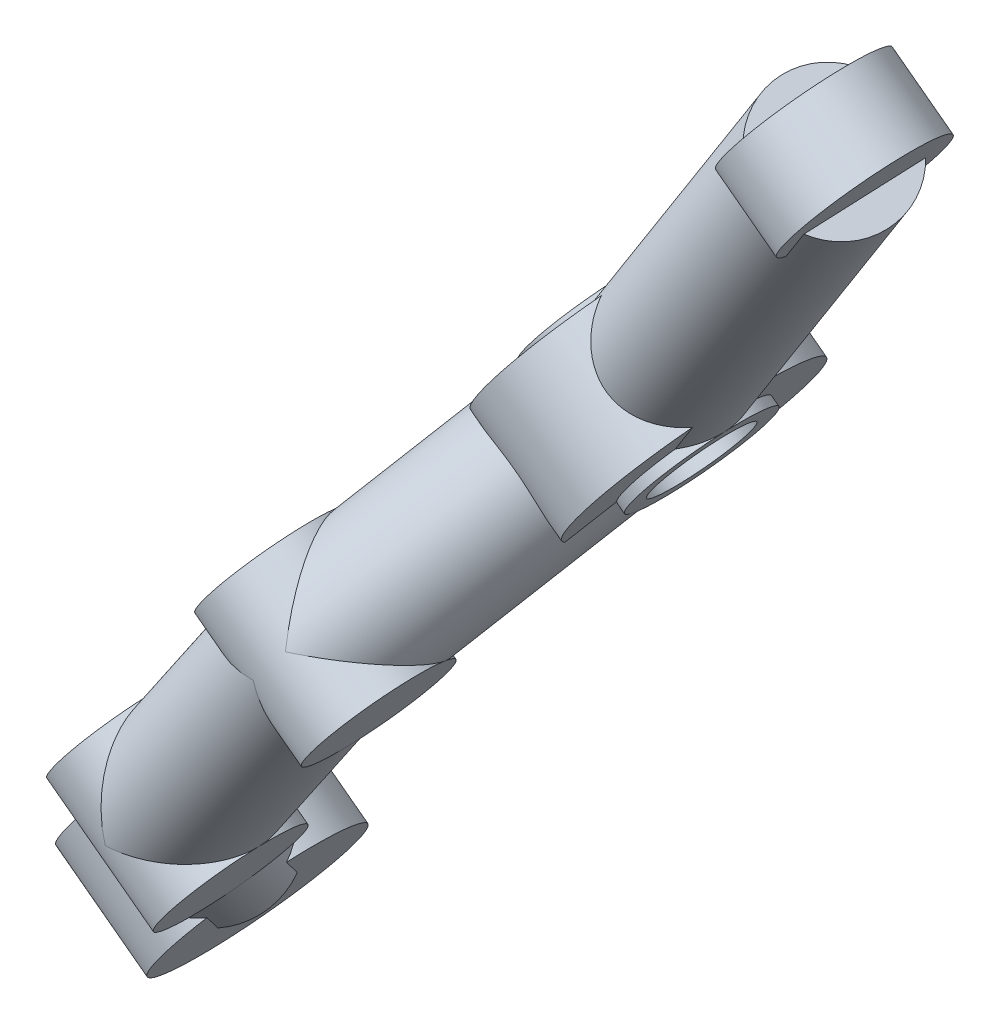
ISO-10303-21;
HEADER;
FILE_DESCRIPTION(('STEP AP214'),'2;1');
FILE_NAME('part.step','',(''),(''),'','','');
FILE_SCHEMA(('AUTOMOTIVE_DESIGN { 1 0 10303 214 1 1 1 1 }'));
ENDSEC;
DATA;
#1=APPLICATION_CONTEXT('core data for automotive mechanical design processes');
#2=APPLICATION_PROTOCOL_DEFINITION('international standard','automotive_design',2000,#1);
#3=PRODUCT_CONTEXT('',#1,'mechanical');
#4=PRODUCT('Part','Part','',(#3));
#5=PRODUCT_RELATED_PRODUCT_CATEGORY('part','',(#4));
#6=PRODUCT_DEFINITION_FORMATION('','',#4);
#7=PRODUCT_DEFINITION_CONTEXT('part definition',#1,'design');
#8=PRODUCT_DEFINITION('design','',#6,#7);
#9=PRODUCT_DEFINITION_SHAPE('','',#8);
#10=(LENGTH_UNIT() NAMED_UNIT(*) SI_UNIT(.MILLI.,.METRE.));
#11=(NAMED_UNIT(*) PLANE_ANGLE_UNIT() SI_UNIT($,.RADIAN.));
#12=(NAMED_UNIT(*) SI_UNIT($,.STERADIAN.) SOLID_ANGLE_UNIT());
#13=UNCERTAINTY_MEASURE_WITH_UNIT(LENGTH_MEASURE(1.E-05),#10,'distance_accuracy_value','');
#14=(GEOMETRIC_REPRESENTATION_CONTEXT(3) GLOBAL_UNCERTAINTY_ASSIGNED_CONTEXT((#13)) GLOBAL_UNIT_ASSIGNED_CONTEXT((#10,
#11,#12)) REPRESENTATION_CONTEXT('',''));
#15=CARTESIAN_POINT('',(0.,0.,0.));
#16=DIRECTION('',(0.,0.,1.));
#17=DIRECTION('',(1.,0.,0.));
#18=AXIS2_PLACEMENT_3D('',#15,#16,#17);
#19=CARTESIAN_POINT('',(-263.128358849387,316.504901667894,22.));
#20=DIRECTION('',(-0.479301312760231,-0.640523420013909,-0.600000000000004));
#21=DIRECTION('',(0.,0.683643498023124,-0.729816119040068));
#22=AXIS2_PLACEMENT_3D('',#19,#20,#21);
#23=PLANE('',#22);
#24=CARTESIAN_POINT('',(-263.128358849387,316.504901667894,22.));
#25=DIRECTION('',(-0.479301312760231,-0.640523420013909,-0.600000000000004));
#26=DIRECTION('',(0.,0.683643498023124,-0.729816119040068));
#27=AXIS2_PLACEMENT_3D('',#24,#25,#26);
#28=CIRCLE('',#27,3.5);
#29=CARTESIAN_POINT('',(-260.078341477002,315.573561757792,20.557779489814));
#30=VERTEX_POINT('',#29);
#31=CARTESIAN_POINT('',(-261.374450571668,313.841481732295,23.442220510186));
#32=VERTEX_POINT('',#31);
#33=EDGE_CURVE('E276',#30,#32,#28,.T.);
#34=ORIENTED_EDGE('',*,*,#33,.T.);
#35=DIRECTION('',(0.359475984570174,0.480392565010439,-0.799999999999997));
#36=VECTOR('',#35,1.);
#37=CARTESIAN_POINT('',(-260.726396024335,314.707521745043,22.));
#38=LINE('',#37,#36);
#39=EDGE_CURVE('E301',#32,#30,#38,.T.);
#40=ORIENTED_EDGE('',*,*,#39,.T.);
#41=EDGE_LOOP('',(#34,#40));
#42=FACE_BOUND('',#41,.T.);
#43=ADVANCED_FACE('F100',(#42),#23,.T.);
#44=CARTESIAN_POINT('',(-255.938839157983,326.112752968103,31.));
#45=DIRECTION('',(-0.479301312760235,-0.640523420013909,-0.6));
#46=DIRECTION('',(0.,0.683643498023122,-0.72981611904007));
#47=AXIS2_PLACEMENT_3D('',#44,#45,#46);
#48=CYLINDRICAL_SURFACE('',#47,3.5);
#49=CARTESIAN_POINT('',(-255.938839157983,326.112752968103,31.));
#50=DIRECTION('',(-0.905065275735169,-0.0292719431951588,-0.42426406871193));
#51=DIRECTION('',(0.227230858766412,-0.876564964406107,-0.424264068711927));
#52=AXIS2_PLACEMENT_3D('',#49,#50,#51);
#53=ELLIPSE('',#52,4.94974746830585,3.5);
#54=CARTESIAN_POINT('',(-254.814103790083,321.773977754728,28.9));
#55=VERTEX_POINT('',#54);
#56=CARTESIAN_POINT('',(-254.450036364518,326.718397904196,27.7822113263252));
#57=VERTEX_POINT('',#56);
#58=EDGE_CURVE('E557',#55,#57,#53,.F.);
#59=ORIENTED_EDGE('',*,*,#58,.F.);
#60=CARTESIAN_POINT('',(-257.197005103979,324.431378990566,33.8));
#61=VERTEX_POINT('',#60);
#62=EDGE_CURVE('E554',#61,#55,#53,.F.);
#63=ORIENTED_EDGE('',*,*,#62,.F.);
#64=CARTESIAN_POINT('',(-255.938839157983,326.112752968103,31.));
#65=DIRECTION('',(0.227230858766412,-0.876564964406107,-0.424264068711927));
#66=DIRECTION('',(-0.905065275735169,-0.0292719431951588,-0.42426406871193));
#67=AXIS2_PLACEMENT_3D('',#64,#65,#66);
#68=ELLIPSE('',#67,4.94974746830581,3.5);
#69=CARTESIAN_POINT('',(-260.418683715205,325.96786424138,28.9));
#70=VERTEX_POINT('',#69);
#71=EDGE_CURVE('E550',#70,#61,#68,.F.);
#72=ORIENTED_EDGE('',*,*,#71,.F.);
#73=CARTESIAN_POINT('',(-255.777774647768,327.711939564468,27.7822113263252));
#74=VERTEX_POINT('',#73);
#75=EDGE_CURVE('E553',#74,#70,#68,.F.);
#76=ORIENTED_EDGE('',*,*,#75,.F.);
#77=CARTESIAN_POINT('',(-255.938839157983,326.112752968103,31.));
#78=DIRECTION('',(-0.55081797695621,-0.736096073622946,-0.393398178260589));
#79=DIRECTION('',(-0.235695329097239,-0.314975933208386,0.919368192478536));
#80=AXIS2_PLACEMENT_3D('',#77,#78,#79);
#81=ELLIPSE('',#80,3.60255219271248,3.49999999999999);
#82=EDGE_CURVE('E533',#74,#57,#81,.T.);
#83=ORIENTED_EDGE('',*,*,#82,.T.);
#84=EDGE_LOOP('',(#59,#63,#72,#76,#83));
#85=FACE_BOUND('',#84,.T.);
#86=CARTESIAN_POINT('',(-259.139138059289,316.82868409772,26.2404342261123));
#87=CARTESIAN_POINT('',(-259.231834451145,316.795448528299,26.2917693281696));
#88=CARTESIAN_POINT('',(-259.327323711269,316.764696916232,26.3395642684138));
#89=CARTESIAN_POINT('',(-259.522848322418,316.708625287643,26.4284221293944));
#90=CARTESIAN_POINT('',(-259.622880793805,316.683301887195,26.4694892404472));
#91=CARTESIAN_POINT('',(-259.827173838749,316.638375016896,26.54552754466));
#92=CARTESIAN_POINT('',(-259.931455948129,316.618806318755,26.5804611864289));
#93=CARTESIAN_POINT('',(-260.142822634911,316.58612289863,26.6444042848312));
#94=CARTESIAN_POINT('',(-260.249907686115,316.57300927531,26.673412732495));
#95=CARTESIAN_POINT('',(-260.46588295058,316.55390552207,26.7259561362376));
#96=CARTESIAN_POINT('',(-260.574770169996,316.547904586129,26.7494993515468));
#97=CARTESIAN_POINT('',(-260.793595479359,316.543781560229,26.7916828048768));
#98=CARTESIAN_POINT('',(-260.903533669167,316.545660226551,26.8103225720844));
#99=CARTESIAN_POINT('',(-261.233055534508,316.564552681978,26.8595835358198));
#100=CARTESIAN_POINT('',(-261.453234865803,316.594730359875,26.8837507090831));
#101=CARTESIAN_POINT('',(-261.815008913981,316.682612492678,26.9132893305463));
#102=CARTESIAN_POINT('',(-261.95922846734,316.728436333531,26.9221993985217));
#103=CARTESIAN_POINT('',(-262.238465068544,316.842914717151,26.9351209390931));
#104=CARTESIAN_POINT('',(-262.373498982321,316.911525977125,26.9391416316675));
#105=CARTESIAN_POINT('',(-262.62994440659,317.07211858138,26.9430304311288));
#106=CARTESIAN_POINT('',(-262.751286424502,317.164212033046,26.9428782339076));
#107=CARTESIAN_POINT('',(-262.975660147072,317.368480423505,26.938342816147));
#108=CARTESIAN_POINT('',(-263.078674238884,317.48067447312,26.9339555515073));
#109=CARTESIAN_POINT('',(-263.280433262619,317.739542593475,26.9190282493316));
#110=CARTESIAN_POINT('',(-263.375697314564,317.888853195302,26.90759591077));
#111=CARTESIAN_POINT('',(-263.541707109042,318.199824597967,26.8759660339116));
#112=CARTESIAN_POINT('',(-263.612387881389,318.361516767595,26.8557455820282));
#113=CARTESIAN_POINT('',(-263.748518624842,318.736026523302,26.7973236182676));
#114=CARTESIAN_POINT('',(-263.807259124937,318.950738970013,26.7557181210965));
#115=CARTESIAN_POINT('',(-263.894622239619,319.380513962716,26.6504126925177));
#116=CARTESIAN_POINT('',(-263.923291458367,319.595575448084,26.5867471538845));
#117=CARTESIAN_POINT('',(-263.945803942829,319.912208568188,26.4718899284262));
#118=CARTESIAN_POINT('',(-263.949896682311,320.016696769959,26.4304094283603));
#119=CARTESIAN_POINT('',(-263.951423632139,320.222594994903,26.3406357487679));
#120=CARTESIAN_POINT('',(-263.948865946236,320.324008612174,26.2923509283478));
#121=CARTESIAN_POINT('',(-263.943063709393,320.423443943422,26.2404342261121));
#122=B_SPLINE_CURVE_WITH_KNOTS('',3,(#86,#87,#88,#89,#90,#91,#92,#93,#94,#95,#96,#97,#98,#99,
#100,#101,#102,#103,#104,#105,#106,#107,#108,#109,#110,#111,#112,#113,#114,#115,#116,#117,#118,
#119,#120,#121),.UNSPECIFIED.,.F.,.F.,(4,2,2,2,2,2,2,2,2,2,2,2,2,2,2,2,2,4),(0.,
0.332966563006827,0.665724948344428,1.00045449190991,1.33524098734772,1.66951820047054,
2.00382749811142,2.66972985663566,3.12280153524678,3.57501751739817,4.02943424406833,
4.48428532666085,5.01385226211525,5.5448083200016,6.22088122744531,6.89590480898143,
7.23299855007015,7.56968172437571),.UNSPECIFIED.);
#123=CARTESIAN_POINT('',(-259.139138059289,316.82868409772,26.2404342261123));
#124=VERTEX_POINT('',#123);
#125=CARTESIAN_POINT('',(-263.943063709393,320.423443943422,26.2404342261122));
#126=VERTEX_POINT('',#125);
#127=EDGE_CURVE('E118',#124,#126,#122,.T.);
#128=ORIENTED_EDGE('',*,*,#127,.F.);
#129=DIRECTION('',(-0.479301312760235,-0.640523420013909,-0.6));
#130=VECTOR('',#129,1.);
#131=CARTESIAN_POINT('',(-254.184930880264,323.449333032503,32.442220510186));
#132=LINE('',#131,#130);
#133=EDGE_CURVE('E12',#124,#32,#132,.T.);
#134=ORIENTED_EDGE('',*,*,#133,.T.);
#135=ORIENTED_EDGE('',*,*,#33,.F.);
#136=DIRECTION('',(-0.479301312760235,-0.640523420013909,-0.6));
#137=VECTOR('',#136,1.);
#138=CARTESIAN_POINT('',(-252.888821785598,325.181413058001,29.557779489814));
#139=LINE('',#138,#137);
#140=CARTESIAN_POINT('',(-257.843028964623,318.560764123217,23.3559932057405));
#141=VERTEX_POINT('',#140);
#142=EDGE_CURVE('E270',#30,#141,#139,.F.);
#143=ORIENTED_EDGE('',*,*,#142,.T.);
#144=CARTESIAN_POINT('',(-262.646954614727,322.155523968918,23.3559932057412));
#145=CARTESIAN_POINT('',(-262.587729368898,322.144029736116,23.2627581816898));
#146=CARTESIAN_POINT('',(-262.52750546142,322.12765382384,23.1708172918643));
#147=CARTESIAN_POINT('',(-262.405137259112,322.085961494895,22.9903806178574));
#148=CARTESIAN_POINT('',(-262.34299418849,322.060650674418,22.9018827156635));
#149=CARTESIAN_POINT('',(-262.216416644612,322.001720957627,22.728558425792));
#150=CARTESIAN_POINT('',(-262.151970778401,321.96805373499,22.6437568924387));
#151=CARTESIAN_POINT('',(-262.02100877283,321.893286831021,22.4791614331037));
#152=CARTESIAN_POINT('',(-261.954492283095,321.852185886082,22.3993683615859));
#153=CARTESIAN_POINT('',(-261.819257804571,321.763390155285,22.2457518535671));
#154=CARTESIAN_POINT('',(-261.750543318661,321.715705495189,22.1719195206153));
#155=CARTESIAN_POINT('',(-261.610528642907,321.614508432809,22.0310791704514));
#156=CARTESIAN_POINT('',(-261.539228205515,321.560995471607,21.9640718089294));
#157=CARTESIAN_POINT('',(-261.321175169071,321.393139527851,21.7752716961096));
#158=CARTESIAN_POINT('',(-261.169729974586,321.271107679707,21.6650616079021));
#159=CARTESIAN_POINT('',(-260.903226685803,321.055908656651,21.5162609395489));
#160=CARTESIAN_POINT('',(-260.792009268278,320.965981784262,21.4660380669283));
#161=CARTESIAN_POINT('',(-260.563348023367,320.783916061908,21.3898051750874));
#162=CARTESIAN_POINT('',(-260.445916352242,320.691781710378,21.3637496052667));
#163=CARTESIAN_POINT('',(-260.206455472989,320.508491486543,21.3385991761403));
#164=CARTESIAN_POINT('',(-260.084406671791,320.417342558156,21.3396361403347));
#165=CARTESIAN_POINT('',(-259.840309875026,320.239431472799,21.3688613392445));
#166=CARTESIAN_POINT('',(-259.718261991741,320.152673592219,21.3970755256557));
#167=CARTESIAN_POINT('',(-259.458841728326,319.970862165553,21.4841844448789));
#168=CARTESIAN_POINT('',(-259.322245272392,319.876786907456,21.5473576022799));
#169=CARTESIAN_POINT('',(-259.059763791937,319.69473727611,21.6997528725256));
#170=CARTESIAN_POINT('',(-258.933907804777,319.606779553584,21.7890428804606));
#171=CARTESIAN_POINT('',(-258.663973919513,319.411080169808,22.0149625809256));
#172=CARTESIAN_POINT('',(-258.524317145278,319.304501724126,22.1578608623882));
#173=CARTESIAN_POINT('',(-258.273776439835,319.092792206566,22.4674356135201));
#174=CARTESIAN_POINT('',(-258.162848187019,318.987659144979,22.6340748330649));
#175=CARTESIAN_POINT('',(-258.022325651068,318.828731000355,22.8966596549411));
#176=CARTESIAN_POINT('',(-257.979814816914,318.775583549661,22.9862327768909));
#177=CARTESIAN_POINT('',(-257.904200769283,318.668693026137,23.1687503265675));
#178=CARTESIAN_POINT('',(-257.87108616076,318.614950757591,23.2616905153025));
#179=CARTESIAN_POINT('',(-257.843028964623,318.560764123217,23.3559932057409));
#180=B_SPLINE_CURVE_WITH_KNOTS('',3,(#144,#145,#146,#147,#148,#149,#150,#151,#152,#153,#154,
#155,#156,#157,#158,#159,#160,#161,#162,#163,#164,#165,#166,#167,#168,#169,#170,#171,#172,#173,
#174,#175,#176,#177,#178,#179),.UNSPECIFIED.,.F.,.F.,(4,2,2,2,2,2,2,2,2,2,2,2,2,2,2,2,2,4),(0.,
0.332966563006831,0.665724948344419,1.00045449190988,1.33524098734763,1.6695182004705,
2.00382749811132,2.66972985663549,3.12280153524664,3.57501751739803,4.0294342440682,
4.48428532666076,5.01385226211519,5.54480832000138,6.22088122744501,6.89590480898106,
7.23299855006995,7.5696817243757),.UNSPECIFIED.);
#181=CARTESIAN_POINT('',(-262.646954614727,322.155523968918,23.3559932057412));
#182=VERTEX_POINT('',#181);
#183=EDGE_CURVE('E273',#182,#141,#180,.T.);
#184=ORIENTED_EDGE('',*,*,#183,.F.);
#185=DIRECTION('',(-0.479301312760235,-0.640523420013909,-0.6));
#186=VECTOR('',#185,1.);
#187=CARTESIAN_POINT('',(-257.692747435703,328.776172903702,29.5577794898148));
#188=LINE('',#187,#186);
#189=CARTESIAN_POINT('',(-264.882267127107,319.168321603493,20.5577794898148));
#190=VERTEX_POINT('',#189);
#191=EDGE_CURVE('E280',#190,#182,#188,.F.);
#192=ORIENTED_EDGE('',*,*,#191,.F.);
#193=CARTESIAN_POINT('',(-266.178376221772,317.436241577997,23.4422205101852));
#194=VERTEX_POINT('',#193);
#195=EDGE_CURVE('E456',#194,#190,#28,.T.);
#196=ORIENTED_EDGE('',*,*,#195,.F.);
#197=DIRECTION('',(-0.479301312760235,-0.640523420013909,-0.6));
#198=VECTOR('',#197,1.);
#199=CARTESIAN_POINT('',(-258.988856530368,327.044092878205,32.4422205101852));
#200=LINE('',#199,#198);
#201=EDGE_CURVE('E109',#126,#194,#200,.T.);
#202=ORIENTED_EDGE('',*,*,#201,.F.);
#203=EDGE_LOOP('',(#128,#134,#135,#143,#184,#192,#196,#202));
#204=FACE_BOUND('',#203,.T.);
#205=ADVANCED_FACE('F272',(#85,#204),#48,.T.);
#206=CARTESIAN_POINT('',(-219.392114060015,374.952663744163,33.));
#207=DIRECTION('',(-0.581238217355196,-0.776748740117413,-0.242535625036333));
#208=DIRECTION('',(0.800654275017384,-0.599126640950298,0.));
#209=AXIS2_PLACEMENT_3D('',#206,#207,#208);
#210=CYLINDRICAL_SURFACE('',#209,3.49999999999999);
#211=CARTESIAN_POINT('',(-230.701369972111,354.832036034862,29.1369228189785));
#212=CARTESIAN_POINT('',(-230.772728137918,354.825094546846,29.2157090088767));
#213=CARTESIAN_POINT('',(-230.847452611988,354.819776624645,29.2915448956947));
#214=CARTESIAN_POINT('',(-231.002721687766,354.812815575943,29.437133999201));
#215=CARTESIAN_POINT('',(-231.08326413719,354.811171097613,29.5068894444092));
#216=CARTESIAN_POINT('',(-231.249639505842,354.811980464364,29.640457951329));
#217=CARTESIAN_POINT('',(-231.335492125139,354.814450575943,29.7042463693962));
#218=CARTESIAN_POINT('',(-231.511310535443,354.824017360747,29.8254576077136));
#219=CARTESIAN_POINT('',(-231.601276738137,354.831114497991,29.8828797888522));
#220=CARTESIAN_POINT('',(-231.87599352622,354.860157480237,30.0454035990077));
#221=CARTESIAN_POINT('',(-232.065781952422,354.889853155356,30.1409358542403));
#222=CARTESIAN_POINT('',(-232.450841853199,354.974993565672,30.3049910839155));
#223=CARTESIAN_POINT('',(-232.646100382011,355.030381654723,30.3735728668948));
#224=CARTESIAN_POINT('',(-232.991910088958,355.156640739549,30.4705902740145));
#225=CARTESIAN_POINT('',(-233.143063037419,355.22163815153,30.5044828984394));
#226=CARTESIAN_POINT('',(-233.438193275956,355.371744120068,30.5537054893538));
#227=CARTESIAN_POINT('',(-233.582178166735,355.456830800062,30.569055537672));
#228=CARTESIAN_POINT('',(-233.85823026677,355.646354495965,30.5806395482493));
#229=CARTESIAN_POINT('',(-233.990265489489,355.750841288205,30.5768236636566));
#230=CARTESIAN_POINT('',(-234.238178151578,355.975409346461,30.5501241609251));
#231=CARTESIAN_POINT('',(-234.354046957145,356.095498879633,30.5272303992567));
#232=CARTESIAN_POINT('',(-234.564912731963,356.342413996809,30.4641353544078));
#233=CARTESIAN_POINT('',(-234.660414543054,356.468946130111,30.4244513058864));
#234=CARTESIAN_POINT('',(-234.835055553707,356.727038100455,30.3287850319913));
#235=CARTESIAN_POINT('',(-234.914183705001,356.858601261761,30.2727918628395));
#236=CARTESIAN_POINT('',(-235.068338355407,357.142998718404,30.1352878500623));
#237=CARTESIAN_POINT('',(-235.140803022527,357.295952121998,30.0511599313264));
#238=CARTESIAN_POINT('',(-235.267279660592,357.596949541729,29.8628365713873));
#239=CARTESIAN_POINT('',(-235.321299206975,357.744995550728,29.7586493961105));
#240=CARTESIAN_POINT('',(-235.397298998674,357.98338235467,29.5686043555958));
#241=CARTESIAN_POINT('',(-235.423963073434,358.076574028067,29.4881313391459));
#242=CARTESIAN_POINT('',(-235.47000273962,358.256714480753,29.3187867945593));
#243=CARTESIAN_POINT('',(-235.489386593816,358.343670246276,29.2299249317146));
#244=CARTESIAN_POINT('',(-235.505295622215,358.426795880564,29.1369228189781));
#245=B_SPLINE_CURVE_WITH_KNOTS('',3,(#211,#212,#213,#214,#215,#216,#217,#218,#219,#220,#221,
#222,#223,#224,#225,#226,#227,#228,#229,#230,#231,#232,#233,#234,#235,#236,#237,#238,#239,#240,
#241,#242,#243,#244),.UNSPECIFIED.,.F.,.F.,(4,2,2,2,2,2,2,2,2,2,2,2,2,2,2,2,4),(0.,
0.319418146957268,0.638718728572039,0.959284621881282,1.27988266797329,1.92024942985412,
2.55921098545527,3.06104886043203,3.5623427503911,4.06494108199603,4.5678068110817,
5.05619570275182,5.54491307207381,6.10980771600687,6.6744700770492,7.05181727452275,
7.42873489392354),.UNSPECIFIED.);
#246=CARTESIAN_POINT('',(-230.701369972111,354.832036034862,29.1369228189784));
#247=VERTEX_POINT('',#246);
#248=CARTESIAN_POINT('',(-235.505295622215,358.426795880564,29.1369228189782));
#249=VERTEX_POINT('',#248);
#250=EDGE_CURVE('E391',#247,#249,#245,.T.);
#251=ORIENTED_EDGE('',*,*,#250,.F.);
#252=DIRECTION('',(-0.581238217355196,-0.776748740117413,-0.242535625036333));
#253=VECTOR('',#252,1.);
#254=CARTESIAN_POINT('',(-217.252111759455,372.805207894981,34.7489492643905));
#255=LINE('',#254,#253);
#256=CARTESIAN_POINT('',(-232.283943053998,352.717134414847,28.4765561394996));
#257=VERTEX_POINT('',#256);
#258=EDGE_CURVE('E327',#247,#257,#255,.T.);
#259=ORIENTED_EDGE('',*,*,#258,.T.);
#260=CARTESIAN_POINT('',(-236.167660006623,352.534344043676,26.));
#261=DIRECTION('',(0.155150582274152,-0.972890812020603,-0.171498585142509));
#262=DIRECTION('',(-0.977145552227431,-0.125597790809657,-0.171498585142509));
#263=AXIS2_PLACEMENT_3D('',#260,#261,#262);
#264=ELLIPSE('',#263,4.94974746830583,3.5);
#265=CARTESIAN_POINT('',(-231.331036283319,353.156021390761,26.8488746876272));
#266=VERTEX_POINT('',#265);
#267=EDGE_CURVE('E509',#266,#257,#264,.T.);
#268=ORIENTED_EDGE('',*,*,#267,.F.);
#269=CARTESIAN_POINT('',(-231.760022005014,353.417286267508,24.9786576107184));
#270=VERTEX_POINT('',#269);
#271=EDGE_CURVE('E523',#270,#266,#264,.T.);
#272=ORIENTED_EDGE('',*,*,#271,.F.);
#273=DIRECTION('',(-0.581238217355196,-0.776748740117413,-0.242535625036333));
#274=VECTOR('',#273,1.);
#275=CARTESIAN_POINT('',(-216.728190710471,373.505359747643,31.2510507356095));
#276=LINE('',#275,#274);
#277=CARTESIAN_POINT('',(-230.177448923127,355.532187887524,25.6390242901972));
#278=VERTEX_POINT('',#277);
#279=EDGE_CURVE('E335',#270,#278,#276,.F.);
#280=ORIENTED_EDGE('',*,*,#279,.T.);
#281=CARTESIAN_POINT('',(-234.981374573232,359.126947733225,25.6390242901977));
#282=CARTESIAN_POINT('',(-234.942286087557,359.090765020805,25.5467728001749));
#283=CARTESIAN_POINT('',(-234.901471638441,359.050766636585,25.4567871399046));
#284=CARTESIAN_POINT('',(-234.816351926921,358.963982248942,25.2819265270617));
#285=CARTESIAN_POINT('',(-234.772047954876,358.917198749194,25.1970497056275));
#286=CARTESIAN_POINT('',(-234.67969900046,358.817462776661,25.0325918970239));
#287=CARTESIAN_POINT('',(-234.631639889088,358.764486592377,24.9530332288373));
#288=CARTESIAN_POINT('',(-234.531804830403,358.653378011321,24.8001161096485));
#289=CARTESIAN_POINT('',(-234.480028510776,358.595245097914,24.7267582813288));
#290=CARTESIAN_POINT('',(-234.31888448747,358.414426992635,24.5168435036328));
#291=CARTESIAN_POINT('',(-234.203583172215,358.285189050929,24.3902297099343));
#292=CARTESIAN_POINT('',(-233.955567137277,358.016907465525,24.1689896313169));
#293=CARTESIAN_POINT('',(-233.822891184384,357.877885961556,24.0742937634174));
#294=CARTESIAN_POINT('',(-233.569377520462,357.628285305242,23.938763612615));
#295=CARTESIAN_POINT('',(-233.452109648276,357.518004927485,23.8907316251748));
#296=CARTESIAN_POINT('',(-233.206975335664,357.301085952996,23.8206470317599));
#297=CARTESIAN_POINT('',(-233.079120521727,357.19444353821,23.7985663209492));
#298=CARTESIAN_POINT('',(-232.815193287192,356.988716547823,23.7819229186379));
#299=CARTESIAN_POINT('',(-232.67910034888,356.889652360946,23.7874319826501));
#300=CARTESIAN_POINT('',(-232.403449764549,356.702152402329,23.8257058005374));
#301=CARTESIAN_POINT('',(-232.263890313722,356.613722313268,23.8584850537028));
#302=CARTESIAN_POINT('',(-231.99033804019,356.450579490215,23.9477375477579));
#303=CARTESIAN_POINT('',(-231.856300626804,356.375545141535,24.0035015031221));
#304=CARTESIAN_POINT('',(-231.593587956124,356.235149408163,24.1359177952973));
#305=CARTESIAN_POINT('',(-231.464916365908,356.169794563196,24.2125841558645));
#306=CARTESIAN_POINT('',(-231.19689113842,356.037570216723,24.397603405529));
#307=CARTESIAN_POINT('',(-231.058998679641,355.972052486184,24.5090326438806));
#308=CARTESIAN_POINT('',(-230.799289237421,355.849103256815,24.752950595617));
#309=CARTESIAN_POINT('',(-230.677465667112,355.79166844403,24.8854306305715));
#310=CARTESIAN_POINT('',(-230.491146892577,355.700708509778,25.1215089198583));
#311=CARTESIAN_POINT('',(-230.421040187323,355.665572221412,25.2201094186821));
#312=CARTESIAN_POINT('',(-230.291195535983,355.597426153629,25.4244236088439));
#313=CARTESIAN_POINT('',(-230.231445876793,355.564413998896,25.5301290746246));
#314=CARTESIAN_POINT('',(-230.177448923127,355.532187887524,25.6390242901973));
#315=B_SPLINE_CURVE_WITH_KNOTS('',3,(#281,#282,#283,#284,#285,#286,#287,#288,#289,#290,#291,
#292,#293,#294,#295,#296,#297,#298,#299,#300,#301,#302,#303,#304,#305,#306,#307,#308,#309,#310,
#311,#312,#313,#314),.UNSPECIFIED.,.F.,.F.,(4,2,2,2,2,2,2,2,2,2,2,2,2,2,2,2,4),(0.,
0.319418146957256,0.638718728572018,0.959284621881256,1.27988266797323,1.92024942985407,
2.55921098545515,3.06104886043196,3.56234275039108,4.06494108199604,4.56780681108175,
5.05619570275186,5.54491307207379,6.10980771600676,6.67447007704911,7.05181727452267,
7.42873489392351),.UNSPECIFIED.);
#316=CARTESIAN_POINT('',(-234.981374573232,359.126947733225,25.6390242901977));
#317=VERTEX_POINT('',#316);
#318=EDGE_CURVE('E383',#317,#278,#315,.T.);
#319=ORIENTED_EDGE('',*,*,#318,.F.);
#320=DIRECTION('',(-0.581238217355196,-0.776748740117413,-0.242535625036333));
#321=VECTOR('',#320,1.);
#322=CARTESIAN_POINT('',(-221.532116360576,377.100119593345,31.2510507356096));
#323=LINE('',#322,#321);
#324=CARTESIAN_POINT('',(-236.563947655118,357.01204611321,24.9786576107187));
#325=VERTEX_POINT('',#324);
#326=EDGE_CURVE('E339',#325,#317,#323,.F.);
#327=ORIENTED_EDGE('',*,*,#326,.F.);
#328=CARTESIAN_POINT('',(-236.167660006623,352.534344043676,26.));
#329=DIRECTION('',(-0.977145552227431,-0.125597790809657,-0.171498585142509));
#330=DIRECTION('',(0.155150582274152,-0.972890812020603,-0.171498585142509));
#331=AXIS2_PLACEMENT_3D('',#328,#329,#330);
#332=ELLIPSE('',#331,4.94974746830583,3.5);
#333=CARTESIAN_POINT('',(-236.935616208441,357.349907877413,26.8488746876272));
#334=VERTEX_POINT('',#333);
#335=EDGE_CURVE('E524',#334,#325,#332,.T.);
#336=ORIENTED_EDGE('',*,*,#335,.F.);
#337=CARTESIAN_POINT('',(-237.087868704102,356.311894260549,28.4765561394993));
#338=VERTEX_POINT('',#337);
#339=EDGE_CURVE('E458',#338,#334,#332,.T.);
#340=ORIENTED_EDGE('',*,*,#339,.F.);
#341=DIRECTION('',(-0.581238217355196,-0.776748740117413,-0.242535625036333));
#342=VECTOR('',#341,1.);
#343=CARTESIAN_POINT('',(-222.056037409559,376.399967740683,34.7489492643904));
#344=LINE('',#343,#342);
#345=EDGE_CURVE('E347',#249,#338,#344,.T.);
#346=ORIENTED_EDGE('',*,*,#345,.F.);
#347=EDGE_LOOP('',(#251,#259,#268,#272,#280,#319,#327,#336,#340,#346));
#348=FACE_BOUND('',#347,.T.);
#349=CARTESIAN_POINT('',(-218.991534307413,372.149793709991,29.5382872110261));
#350=CARTESIAN_POINT('',(-219.01085749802,372.238185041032,29.5039990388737));
#351=CARTESIAN_POINT('',(-219.031821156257,372.32715161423,29.4720776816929));
#352=CARTESIAN_POINT('',(-219.077775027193,372.505751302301,29.4127378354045));
#353=CARTESIAN_POINT('',(-219.102773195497,372.595385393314,29.3853284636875));
#354=CARTESIAN_POINT('',(-219.158025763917,372.77629712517,29.3344053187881));
#355=CARTESIAN_POINT('',(-219.188376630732,372.86757116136,29.3109820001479));
#356=CARTESIAN_POINT('',(-219.25506614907,373.048882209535,29.268595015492));
#357=CARTESIAN_POINT('',(-219.291399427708,373.138920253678,29.2496273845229));
#358=CARTESIAN_POINT('',(-219.380105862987,373.335485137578,29.2124239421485));
#359=CARTESIAN_POINT('',(-219.434247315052,373.441430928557,29.1952078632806));
#360=CARTESIAN_POINT('',(-219.556513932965,373.645275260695,29.1671674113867));
#361=CARTESIAN_POINT('',(-219.624553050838,373.743218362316,29.1563052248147));
#362=CARTESIAN_POINT('',(-219.764181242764,373.910213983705,29.142261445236));
#363=CARTESIAN_POINT('',(-219.833151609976,373.981338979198,29.1380808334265));
#364=CARTESIAN_POINT('',(-219.982133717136,374.111046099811,29.1341701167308));
#365=CARTESIAN_POINT('',(-220.062137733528,374.169636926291,29.1344369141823));
#366=CARTESIAN_POINT('',(-220.230342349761,374.27244838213,29.1393992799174));
#367=CARTESIAN_POINT('',(-220.31851679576,374.316712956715,29.1440811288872));
#368=CARTESIAN_POINT('',(-220.500083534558,374.392117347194,29.1577747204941));
#369=CARTESIAN_POINT('',(-220.593487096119,374.423227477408,29.1667961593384));
#370=CARTESIAN_POINT('',(-220.770743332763,374.471287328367,29.1877007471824));
#371=CARTESIAN_POINT('',(-220.854321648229,374.489525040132,29.1990819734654));
#372=CARTESIAN_POINT('',(-221.022172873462,374.519279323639,29.225120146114));
#373=CARTESIAN_POINT('',(-221.106446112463,374.530792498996,29.2397787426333));
#374=CARTESIAN_POINT('',(-221.275112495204,374.548479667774,29.2724624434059));
#375=CARTESIAN_POINT('',(-221.35950534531,374.554639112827,29.2904965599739));
#376=CARTESIAN_POINT('',(-221.527643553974,374.562647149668,29.3299809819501));
#377=CARTESIAN_POINT('',(-221.611389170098,374.564497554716,29.3514298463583));
#378=CARTESIAN_POINT('',(-221.779397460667,374.564726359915,29.3982740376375));
#379=CARTESIAN_POINT('',(-221.863642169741,374.563041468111,29.4237336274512));
#380=CARTESIAN_POINT('',(-222.030245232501,374.556713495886,29.4782632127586));
#381=CARTESIAN_POINT('',(-222.112612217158,374.552089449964,29.5073090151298));
#382=CARTESIAN_POINT('',(-222.194151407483,374.546300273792,29.5382872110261));
#383=B_SPLINE_CURVE_WITH_KNOTS('',3,(#349,#350,#351,#352,#353,#354,#355,#356,#357,#358,#359,
#360,#361,#362,#363,#364,#365,#366,#367,#368,#369,#370,#371,#372,#373,#374,#375,#376,#377,#378,
#379,#380,#381,#382),.UNSPECIFIED.,.F.,.F.,(4,2,2,2,2,2,2,2,2,2,2,2,2,2,2,2,4),(0.,
0.290250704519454,0.581080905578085,0.877819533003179,1.1742930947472,1.53402688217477,
1.89159743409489,2.18772895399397,2.48365422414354,2.77866295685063,3.07433392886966,
3.33285850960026,3.59151355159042,3.85086929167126,4.11011587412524,4.37404327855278,
4.63627861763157),.UNSPECIFIED.);
#384=CARTESIAN_POINT('',(-218.991534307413,372.149793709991,29.5382872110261));
#385=VERTEX_POINT('',#384);
#386=CARTESIAN_POINT('',(-222.194151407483,374.546300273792,29.538287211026));
#387=VERTEX_POINT('',#386);
#388=EDGE_CURVE('E289',#385,#387,#383,.T.);
#389=ORIENTED_EDGE('',*,*,#388,.F.);
#390=DIRECTION('',(-0.581238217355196,-0.776748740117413,-0.242535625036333));
#391=VECTOR('',#390,1.);
#392=CARTESIAN_POINT('',(-217.37343559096,374.31217068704,30.2134778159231));
#393=LINE('',#392,#391);
#394=CARTESIAN_POINT('',(-217.37343559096,374.31217068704,30.2134778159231));
#395=VERTEX_POINT('',#394);
#396=EDGE_CURVE('E316',#385,#395,#393,.F.);
#397=ORIENTED_EDGE('',*,*,#396,.T.);
#398=CARTESIAN_POINT('',(-219.392114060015,374.952663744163,33.));
#399=DIRECTION('',(-0.581238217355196,-0.776748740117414,-0.242535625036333));
#400=DIRECTION('',(0.800654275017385,-0.599126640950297,0.));
#401=AXIS2_PLACEMENT_3D('',#398,#399,#400);
#402=CIRCLE('',#401,3.49999999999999);
#403=CARTESIAN_POINT('',(-218.208175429,373.196650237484,35.7865221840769));
#404=VERTEX_POINT('',#403);
#405=EDGE_CURVE('E526',#395,#404,#402,.T.);
#406=ORIENTED_EDGE('',*,*,#405,.T.);
#407=DIRECTION('',(-0.581238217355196,-0.776748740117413,-0.242535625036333));
#408=VECTOR('',#407,1.);
#409=CARTESIAN_POINT('',(-218.208175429,373.196650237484,35.7865221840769));
#410=LINE('',#409,#408);
#411=CARTESIAN_POINT('',(-219.826274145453,371.034273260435,35.1113315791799));
#412=VERTEX_POINT('',#411);
#413=EDGE_CURVE('E313',#404,#412,#410,.T.);
#414=ORIENTED_EDGE('',*,*,#413,.T.);
#415=CARTESIAN_POINT('',(-223.028891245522,373.430779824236,35.1113315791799));
#416=CARTESIAN_POINT('',(-222.952478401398,373.418681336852,35.1694417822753));
#417=CARTESIAN_POINT('',(-222.874346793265,373.406112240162,35.2252178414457));
#418=CARTESIAN_POINT('',(-222.714906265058,373.379172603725,35.3319127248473));
#419=CARTESIAN_POINT('',(-222.633591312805,373.36479851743,35.3828216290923));
#420=CARTESIAN_POINT('',(-222.466674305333,373.333111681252,35.4803394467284));
#421=CARTESIAN_POINT('',(-222.381018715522,373.315745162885,35.5268399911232));
#422=CARTESIAN_POINT('',(-222.207625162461,373.277030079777,35.6137518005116));
#423=CARTESIAN_POINT('',(-222.119889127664,373.255685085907,35.6541684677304));
#424=CARTESIAN_POINT('',(-221.924120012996,373.202195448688,35.7360463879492));
#425=CARTESIAN_POINT('',(-221.815750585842,373.168718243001,35.7758903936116));
#426=CARTESIAN_POINT('',(-221.599940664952,373.089882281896,35.8429640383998));
#427=CARTESIAN_POINT('',(-221.492498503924,373.044596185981,35.8702680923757));
#428=CARTESIAN_POINT('',(-221.300384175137,372.94774141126,35.9062129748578));
#429=CARTESIAN_POINT('',(-221.214971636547,372.898589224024,35.9172544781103));
#430=CARTESIAN_POINT('',(-221.050636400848,372.789399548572,35.9275716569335));
#431=CARTESIAN_POINT('',(-220.971709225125,372.729369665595,35.9268555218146));
#432=CARTESIAN_POINT('',(-220.822923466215,372.600607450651,35.9137901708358));
#433=CARTESIAN_POINT('',(-220.753037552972,372.531902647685,35.9014769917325));
#434=CARTESIAN_POINT('',(-220.622203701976,372.388700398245,35.8666138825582));
#435=CARTESIAN_POINT('',(-220.561276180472,372.314190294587,35.8440410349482));
#436=CARTESIAN_POINT('',(-220.454498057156,372.171945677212,35.7937277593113));
#437=CARTESIAN_POINT('',(-220.407714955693,372.1045359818,35.7669928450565));
#438=CARTESIAN_POINT('',(-220.319068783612,371.968934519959,35.7079044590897));
#439=CARTESIAN_POINT('',(-220.277208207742,371.900742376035,35.6755481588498));
#440=CARTESIAN_POINT('',(-220.197320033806,371.764414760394,35.6058196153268));
#441=CARTESIAN_POINT('',(-220.159303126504,371.696279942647,35.568434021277));
#442=CARTESIAN_POINT('',(-220.086408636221,371.560991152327,35.4892068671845));
#443=CARTESIAN_POINT('',(-220.051529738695,371.493836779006,35.447367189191));
#444=CARTESIAN_POINT('',(-219.983626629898,371.359830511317,35.3587517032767));
#445=CARTESIAN_POINT('',(-219.950647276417,371.293005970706,35.3119004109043));
#446=CARTESIAN_POINT('',(-219.886953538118,371.161809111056,35.2144294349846));
#447=CARTESIAN_POINT('',(-219.856225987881,371.097423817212,35.1638358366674));
#448=CARTESIAN_POINT('',(-219.826274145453,371.034273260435,35.1113315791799));
#449=B_SPLINE_CURVE_WITH_KNOTS('',3,(#415,#416,#417,#418,#419,#420,#421,#422,#423,#424,#425,
#426,#427,#428,#429,#430,#431,#432,#433,#434,#435,#436,#437,#438,#439,#440,#441,#442,#443,#444,
#445,#446,#447,#448),.UNSPECIFIED.,.F.,.F.,(4,2,2,2,2,2,2,2,2,2,2,2,2,2,2,2,4),(0.,
0.290250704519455,0.581080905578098,0.8778195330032,1.17429309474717,1.53402688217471,
1.8915974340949,2.18772895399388,2.48365422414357,2.77866295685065,3.07433392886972,
3.33285850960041,3.59151355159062,3.85086929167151,4.11011587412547,4.37404327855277,
4.63627861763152),.UNSPECIFIED.);
#450=CARTESIAN_POINT('',(-223.028891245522,373.430779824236,35.1113315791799));
#451=VERTEX_POINT('',#450);
#452=EDGE_CURVE('E409',#451,#412,#449,.T.);
#453=ORIENTED_EDGE('',*,*,#452,.F.);
#454=DIRECTION('',(-0.581238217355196,-0.776748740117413,-0.242535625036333));
#455=VECTOR('',#454,1.);
#456=CARTESIAN_POINT('',(-221.41079252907,375.593156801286,35.786522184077));
#457=LINE('',#456,#455);
#458=CARTESIAN_POINT('',(-221.41079252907,375.593156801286,35.7865221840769));
#459=VERTEX_POINT('',#458);
#460=EDGE_CURVE('E309',#459,#451,#457,.T.);
#461=ORIENTED_EDGE('',*,*,#460,.F.);
#462=CARTESIAN_POINT('',(-220.57605269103,376.708677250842,30.213477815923));
#463=VERTEX_POINT('',#462);
#464=EDGE_CURVE('E529',#459,#463,#402,.T.);
#465=ORIENTED_EDGE('',*,*,#464,.T.);
#466=DIRECTION('',(-0.581238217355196,-0.776748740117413,-0.242535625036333));
#467=VECTOR('',#466,1.);
#468=CARTESIAN_POINT('',(-220.57605269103,376.708677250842,30.213477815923));
#469=LINE('',#468,#467);
#470=EDGE_CURVE('E311',#387,#463,#469,.F.);
#471=ORIENTED_EDGE('',*,*,#470,.F.);
#472=EDGE_LOOP('',(#389,#397,#406,#414,#453,#461,#465,#471));
#473=FACE_BOUND('',#472,.T.);
#474=ADVANCED_FACE('F399',(#348,#473),#210,.T.);
#475=CARTESIAN_POINT('',(-219.392114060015,374.952663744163,33.));
#476=DIRECTION('',(-0.581238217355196,-0.776748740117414,-0.242535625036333));
#477=DIRECTION('',(0.800654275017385,-0.599126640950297,0.));
#478=AXIS2_PLACEMENT_3D('',#475,#476,#477);
#479=PLANE('',#478);
#480=DIRECTION('',(0.145309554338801,0.194187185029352,-0.970142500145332));
#481=VECTOR('',#480,1.);
#482=CARTESIAN_POINT('',(-217.79080550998,373.754410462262,33.));
#483=LINE('',#482,#481);
#484=EDGE_CURVE('E415',#404,#395,#483,.T.);
#485=ORIENTED_EDGE('',*,*,#484,.F.);
#486=ORIENTED_EDGE('',*,*,#405,.F.);
#487=EDGE_LOOP('',(#485,#486));
#488=FACE_BOUND('',#487,.T.);
#489=ADVANCED_FACE('F402',(#488),#479,.F.);
#490=CARTESIAN_POINT('',(-236.167660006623,352.534344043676,26.));
#491=DIRECTION('',(-0.528641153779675,-0.706459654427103,0.470588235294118));
#492=DIRECTION('',(0.800654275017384,-0.599126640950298,0.));
#493=AXIS2_PLACEMENT_3D('',#490,#491,#492);
#494=CYLINDRICAL_SURFACE('',#493,3.49999999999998);
#495=CARTESIAN_POINT('',(-245.154559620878,340.524529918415,34.));
#496=DIRECTION('',(-0.93995381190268,-0.0758959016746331,0.332756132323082));
#497=DIRECTION('',(0.1923423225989,-0.923188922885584,0.332756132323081));
#498=AXIS2_PLACEMENT_3D('',#495,#496,#497);
#499=ELLIPSE('',#498,4.94974746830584,3.49999999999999);
#500=CARTESIAN_POINT('',(-246.10660554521,345.094081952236,32.3529411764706));
#501=VERTEX_POINT('',#500);
#502=CARTESIAN_POINT('',(-246.395189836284,340.74606730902,30.5460551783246));
#503=VERTEX_POINT('',#502);
#504=EDGE_CURVE('E685',#501,#503,#499,.T.);
#505=ORIENTED_EDGE('',*,*,#504,.F.);
#506=CARTESIAN_POINT('',(-244.167762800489,341.843254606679,37.0882352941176));
#507=VERTEX_POINT('',#506);
#508=EDGE_CURVE('E687',#507,#501,#499,.T.);
#509=ORIENTED_EDGE('',*,*,#508,.F.);
#510=CARTESIAN_POINT('',(-245.154559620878,340.524529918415,34.));
#511=DIRECTION('',(0.1923423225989,-0.923188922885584,0.332756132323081));
#512=DIRECTION('',(-0.93995381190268,-0.0758959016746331,0.332756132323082));
#513=AXIS2_PLACEMENT_3D('',#510,#511,#512);
#514=ELLIPSE('',#513,4.94974746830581,3.49999999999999);
#515=CARTESIAN_POINT('',(-240.502025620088,340.900195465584,32.3529411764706));
#516=VERTEX_POINT('',#515);
#517=EDGE_CURVE('E518',#516,#507,#514,.T.);
#518=ORIENTED_EDGE('',*,*,#517,.F.);
#519=CARTESIAN_POINT('',(-244.592044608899,339.39678038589,30.5460551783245));
#520=VERTEX_POINT('',#519);
#521=EDGE_CURVE('E502',#520,#516,#514,.T.);
#522=ORIENTED_EDGE('',*,*,#521,.F.);
#523=CARTESIAN_POINT('',(-245.154559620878,340.524529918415,34.));
#524=DIRECTION('',(-0.591242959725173,-0.790118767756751,0.16169135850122));
#525=DIRECTION('',(0.0968736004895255,0.129458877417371,0.986841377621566));
#526=AXIS2_PLACEMENT_3D('',#523,#524,#525);
#527=ELLIPSE('',#526,3.696535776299,3.49999999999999);
#528=EDGE_CURVE('E530',#503,#520,#527,.T.);
#529=ORIENTED_EDGE('',*,*,#528,.F.);
#530=EDGE_LOOP('',(#505,#509,#518,#522,#529));
#531=FACE_BOUND('',#530,.T.);
#532=CARTESIAN_POINT('',(-237.299262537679,346.014816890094,27.1023798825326));
#533=CARTESIAN_POINT('',(-237.351855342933,346.032952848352,27.0115365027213));
#534=CARTESIAN_POINT('',(-237.405881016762,346.055296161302,26.9224011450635));
#535=CARTESIAN_POINT('',(-237.516740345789,346.107682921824,26.7482777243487));
#536=CARTESIAN_POINT('',(-237.573572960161,346.13772353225,26.6632881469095));
#537=CARTESIAN_POINT('',(-237.690257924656,346.204937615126,26.4977923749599));
#538=CARTESIAN_POINT('',(-237.750121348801,346.242138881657,26.417305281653));
#539=CARTESIAN_POINT('',(-237.872698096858,346.322856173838,26.2618850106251));
#540=CARTESIAN_POINT('',(-237.935411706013,346.366372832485,26.1869523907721));
#541=CARTESIAN_POINT('',(-238.127921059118,346.505275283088,25.9716083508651));
#542=CARTESIAN_POINT('',(-238.262235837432,346.60910422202,25.8404329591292));
#543=CARTESIAN_POINT('',(-238.543584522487,346.832841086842,25.6097408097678));
#544=CARTESIAN_POINT('',(-238.690589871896,346.952713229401,25.5101552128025));
#545=CARTESIAN_POINT('',(-238.964655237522,347.174849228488,25.3670403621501));
#546=CARTESIAN_POINT('',(-239.089225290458,347.275371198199,25.316067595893));
#547=CARTESIAN_POINT('',(-239.345023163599,347.478039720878,25.2415730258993));
#548=CARTESIAN_POINT('',(-239.476243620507,347.580184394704,25.2180215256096));
#549=CARTESIAN_POINT('',(-239.742707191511,347.782521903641,25.200276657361));
#550=CARTESIAN_POINT('',(-239.877959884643,347.882708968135,25.2061598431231));
#551=CARTESIAN_POINT('',(-240.147780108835,348.078000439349,25.2469354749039));
#552=CARTESIAN_POINT('',(-240.282347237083,348.173102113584,25.2818433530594));
#553=CARTESIAN_POINT('',(-240.542335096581,348.354371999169,25.3765005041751));
#554=CARTESIAN_POINT('',(-240.667907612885,348.440718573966,25.4355056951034));
#555=CARTESIAN_POINT('',(-240.910574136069,348.607903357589,25.5748799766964));
#556=CARTESIAN_POINT('',(-241.02766238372,348.688737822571,25.6552634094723));
#557=CARTESIAN_POINT('',(-241.267823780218,348.858198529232,25.8480287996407));
#558=CARTESIAN_POINT('',(-241.38898502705,348.946075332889,25.9634454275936));
#559=CARTESIAN_POINT('',(-241.612228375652,349.117756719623,26.2139436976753));
#560=CARTESIAN_POINT('',(-241.714318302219,349.201562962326,26.3490172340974));
#561=CARTESIAN_POINT('',(-241.86563855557,349.339293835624,26.587457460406));
#562=CARTESIAN_POINT('',(-241.921169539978,349.393908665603,26.686478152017));
#563=CARTESIAN_POINT('',(-242.02090980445,349.50228530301,26.8903266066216));
#564=CARTESIAN_POINT('',(-242.065131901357,349.556048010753,26.9951476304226));
#565=CARTESIAN_POINT('',(-242.103188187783,349.609576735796,27.1023798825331));
#566=B_SPLINE_CURVE_WITH_KNOTS('',3,(#532,#533,#534,#535,#536,#537,#538,#539,#540,#541,#542,
#543,#544,#545,#546,#547,#548,#549,#550,#551,#552,#553,#554,#555,#556,#557,#558,#559,#560,#561,
#562,#563,#564,#565),.UNSPECIFIED.,.F.,.F.,(4,2,2,2,2,2,2,2,2,2,2,2,2,2,2,2,4),(0.,
0.319418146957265,0.638718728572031,0.959284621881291,1.2798826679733,1.92024942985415,
2.55921098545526,3.06104886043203,3.56234275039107,4.06494108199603,4.56780681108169,
5.0561957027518,5.54491307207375,6.10980771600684,6.67447007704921,7.05181727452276,
7.42873489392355),.UNSPECIFIED.);
#567=CARTESIAN_POINT('',(-237.299262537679,346.014816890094,27.1023798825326));
#568=VERTEX_POINT('',#567);
#569=CARTESIAN_POINT('',(-242.103188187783,349.609576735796,27.1023798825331));
#570=VERTEX_POINT('',#569);
#571=EDGE_CURVE('E359',#568,#570,#566,.T.);
#572=ORIENTED_EDGE('',*,*,#571,.F.);
#573=DIRECTION('',(-0.528641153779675,-0.706459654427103,0.470588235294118));
#574=VECTOR('',#573,1.);
#575=CARTESIAN_POINT('',(-234.273975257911,350.057717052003,24.4093156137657));
#576=LINE('',#575,#574);
#577=CARTESIAN_POINT('',(-235.85989871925,347.938338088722,25.8210803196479));
#578=VERTEX_POINT('',#577);
#579=EDGE_CURVE('E337',#568,#578,#576,.F.);
#580=ORIENTED_EDGE('',*,*,#579,.T.);
#581=CARTESIAN_POINT('',(-236.167660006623,352.534344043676,26.));
#582=DIRECTION('',(-0.93995381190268,-0.0758959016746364,0.332756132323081));
#583=DIRECTION('',(0.192342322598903,-0.923188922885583,0.332756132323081));
#584=AXIS2_PLACEMENT_3D('',#581,#582,#583);
#585=ELLIPSE('',#584,4.94974746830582,3.49999999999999);
#586=CARTESIAN_POINT('',(-235.215614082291,347.964792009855,27.6470588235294));
#587=VERTEX_POINT('',#586);
#588=EDGE_CURVE('E540',#587,#578,#585,.F.);
#589=ORIENTED_EDGE('',*,*,#588,.F.);
#590=CARTESIAN_POINT('',(-234.843342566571,349.296832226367,29.0024490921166));
#591=VERTEX_POINT('',#590);
#592=EDGE_CURVE('E511',#591,#587,#585,.F.);
#593=ORIENTED_EDGE('',*,*,#592,.F.);
#594=DIRECTION('',(-0.528641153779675,-0.706459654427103,0.470588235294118));
#595=VECTOR('',#594,1.);
#596=CARTESIAN_POINT('',(-233.257419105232,351.416211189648,27.5906843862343));
#597=LINE('',#596,#595);
#598=CARTESIAN_POINT('',(-236.282706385,347.373311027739,30.2837486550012));
#599=VERTEX_POINT('',#598);
#600=EDGE_CURVE('E330',#591,#599,#597,.T.);
#601=ORIENTED_EDGE('',*,*,#600,.T.);
#602=CARTESIAN_POINT('',(-241.086632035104,350.96807087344,30.2837486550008));
#603=CARTESIAN_POINT('',(-241.004689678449,350.989156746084,30.348465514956));
#604=CARTESIAN_POINT('',(-240.919822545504,351.008029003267,30.4101462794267));
#605=CARTESIAN_POINT('',(-240.745161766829,351.040904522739,30.5274746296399));
#606=CARTESIAN_POINT('',(-240.655369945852,351.05490957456,30.5831244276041));
#607=CARTESIAN_POINT('',(-240.471357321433,351.077670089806,30.6886861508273));
#608=CARTESIAN_POINT('',(-240.377120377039,351.086404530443,30.7385744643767));
#609=CARTESIAN_POINT('',(-240.185436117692,351.098040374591,30.8324762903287));
#610=CARTESIAN_POINT('',(-240.087988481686,351.100941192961,30.8764892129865));
#611=CARTESIAN_POINT('',(-239.792183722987,351.100079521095,30.9998812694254));
#612=CARTESIAN_POINT('',(-239.590122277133,351.086785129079,31.0707496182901));
#613=CARTESIAN_POINT('',(-239.184131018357,351.029616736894,31.1904868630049));
#614=CARTESIAN_POINT('',(-238.980206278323,350.985809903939,31.2394036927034));
#615=CARTESIAN_POINT('',(-238.622196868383,350.875854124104,31.3077928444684));
#616=CARTESIAN_POINT('',(-238.466808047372,350.816517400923,31.3313312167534));
#617=CARTESIAN_POINT('',(-238.165538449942,350.674615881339,31.3653475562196));
#618=CARTESIAN_POINT('',(-238.019647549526,350.592076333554,31.3758396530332));
#619=CARTESIAN_POINT('',(-237.742156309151,350.404475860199,31.3837678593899));
#620=CARTESIAN_POINT('',(-237.610594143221,350.299356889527,31.3811699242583));
#621=CARTESIAN_POINT('',(-237.366001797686,350.070351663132,31.362851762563));
#622=CARTESIAN_POINT('',(-237.252981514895,349.946455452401,31.3471245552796));
#623=CARTESIAN_POINT('',(-237.050007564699,349.688993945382,31.3032203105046));
#624=CARTESIAN_POINT('',(-236.959483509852,349.555809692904,31.2754147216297));
#625=CARTESIAN_POINT('',(-236.796918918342,349.281579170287,31.207345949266));
#626=CARTESIAN_POINT('',(-236.72489085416,349.140527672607,31.1670743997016));
#627=CARTESIAN_POINT('',(-236.588295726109,348.832664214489,31.0665021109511));
#628=CARTESIAN_POINT('',(-236.52664161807,348.665263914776,31.0040578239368));
#629=CARTESIAN_POINT('',(-236.424574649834,348.331646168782,30.8614289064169));
#630=CARTESIAN_POINT('',(-236.384153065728,348.16542826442,30.7812515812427));
#631=CARTESIAN_POINT('',(-236.333168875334,347.89361138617,30.6321289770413));
#632=CARTESIAN_POINT('',(-236.317149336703,347.786194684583,30.5682807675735));
#633=CARTESIAN_POINT('',(-236.293630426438,347.57595819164,30.4322833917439));
#634=CARTESIAN_POINT('',(-236.286121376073,347.473133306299,30.3601437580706));
#635=CARTESIAN_POINT('',(-236.282706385,347.373311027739,30.2837486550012));
#636=B_SPLINE_CURVE_WITH_KNOTS('',3,(#602,#603,#604,#605,#606,#607,#608,#609,#610,#611,#612,
#613,#614,#615,#616,#617,#618,#619,#620,#621,#622,#623,#624,#625,#626,#627,#628,#629,#630,#631,
#632,#633,#634,#635),.UNSPECIFIED.,.F.,.F.,(4,2,2,2,2,2,2,2,2,2,2,2,2,2,2,2,4),(0.,
0.31941814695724,0.638718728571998,0.959284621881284,1.27988266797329,1.92024942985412,
2.55921098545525,3.06104886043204,3.56234275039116,4.06494108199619,4.56780681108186,
5.05619570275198,5.54491307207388,6.10980771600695,6.6744700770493,7.05181727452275,
7.42873489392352),.UNSPECIFIED.);
#637=CARTESIAN_POINT('',(-241.086632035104,350.96807087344,30.2837486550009));
#638=VERTEX_POINT('',#637);
#639=EDGE_CURVE('E351',#638,#599,#636,.T.);
#640=ORIENTED_EDGE('',*,*,#639,.F.);
#641=DIRECTION('',(-0.528641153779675,-0.706459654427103,0.470588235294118));
#642=VECTOR('',#641,1.);
#643=CARTESIAN_POINT('',(-238.061344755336,355.010971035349,27.5906843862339));
#644=LINE('',#643,#642);
#645=CARTESIAN_POINT('',(-239.647268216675,352.891592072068,29.0024490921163));
#646=VERTEX_POINT('',#645);
#647=EDGE_CURVE('E349',#646,#638,#644,.T.);
#648=ORIENTED_EDGE('',*,*,#647,.F.);
#649=CARTESIAN_POINT('',(-236.167660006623,352.534344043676,26.));
#650=DIRECTION('',(0.192342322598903,-0.923188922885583,0.332756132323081));
#651=DIRECTION('',(-0.93995381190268,-0.0758959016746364,0.332756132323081));
#652=AXIS2_PLACEMENT_3D('',#649,#650,#651);
#653=ELLIPSE('',#652,4.94974746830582,3.49999999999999);
#654=CARTESIAN_POINT('',(-240.820194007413,352.158678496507,27.6470588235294));
#655=VERTEX_POINT('',#654);
#656=EDGE_CURVE('E536',#655,#646,#653,.F.);
#657=ORIENTED_EDGE('',*,*,#656,.F.);
#658=CARTESIAN_POINT('',(-240.663824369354,351.533097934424,25.8210803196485));
#659=VERTEX_POINT('',#658);
#660=EDGE_CURVE('E539',#659,#655,#653,.F.);
#661=ORIENTED_EDGE('',*,*,#660,.F.);
#662=DIRECTION('',(-0.528641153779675,-0.706459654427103,0.470588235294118));
#663=VECTOR('',#662,1.);
#664=CARTESIAN_POINT('',(-239.077900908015,353.652476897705,24.409315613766));
#665=LINE('',#664,#663);
#666=EDGE_CURVE('E342',#570,#659,#665,.F.);
#667=ORIENTED_EDGE('',*,*,#666,.F.);
#668=EDGE_LOOP('',(#572,#580,#589,#593,#601,#640,#648,#657,#661,#667));
#669=FACE_BOUND('',#668,.T.);
#670=ADVANCED_FACE('F365',(#531,#669),#494,.T.);
#671=CARTESIAN_POINT('',(-233.365370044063,350.43740080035,26.));
#672=DIRECTION('',(-0.800654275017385,0.599126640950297,0.));
#673=DIRECTION('',(-0.599126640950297,-0.800654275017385,0.));
#674=AXIS2_PLACEMENT_3D('',#671,#672,#673);
#675=CYLINDRICAL_SURFACE('',#674,3.5);
#676=ORIENTED_EDGE('',*,*,#588,.T.);
#677=CARTESIAN_POINT('',(-233.765697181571,350.736964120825,26.));
#678=DIRECTION('',(-0.800654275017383,0.599126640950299,0.));
#679=DIRECTION('',(-0.599126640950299,-0.800654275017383,0.));
#680=AXIS2_PLACEMENT_3D('',#677,#678,#679);
#681=CIRCLE('',#680,3.5);
#682=EDGE_CURVE('E333',#578,#270,#681,.F.);
#683=ORIENTED_EDGE('',*,*,#682,.T.);
#684=ORIENTED_EDGE('',*,*,#271,.T.);
#685=CARTESIAN_POINT('',(-233.365370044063,350.43740080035,26.));
#686=DIRECTION('',(-0.800654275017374,0.599126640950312,0.));
#687=DIRECTION('',(-0.599126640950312,-0.800654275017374,0.));
#688=AXIS2_PLACEMENT_3D('',#685,#686,#687);
#689=CIRCLE('',#688,3.5);
#690=EDGE_CURVE('E497',#266,#587,#689,.T.);
#691=ORIENTED_EDGE('',*,*,#690,.T.);
#692=EDGE_LOOP('',(#676,#683,#684,#691));
#693=FACE_BOUND('',#692,.T.);
#694=ADVANCED_FACE('F574',(#693),#675,.T.);
#695=ORIENTED_EDGE('',*,*,#267,.T.);
#696=CARTESIAN_POINT('',(-233.765697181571,350.736964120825,26.));
#697=DIRECTION('',(-0.800654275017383,0.599126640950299,0.));
#698=DIRECTION('',(-0.599126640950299,-0.800654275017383,0.));
#699=AXIS2_PLACEMENT_3D('',#696,#697,#698);
#700=CIRCLE('',#699,3.5);
#701=EDGE_CURVE('E558',#257,#591,#700,.F.);
#702=ORIENTED_EDGE('',*,*,#701,.T.);
#703=ORIENTED_EDGE('',*,*,#592,.T.);
#704=EDGE_CURVE('E499',#587,#266,#689,.T.);
#705=ORIENTED_EDGE('',*,*,#704,.T.);
#706=EDGE_LOOP('',(#695,#702,#703,#705));
#707=FACE_BOUND('',#706,.T.);
#708=ADVANCED_FACE('F506',(#707),#675,.T.);
#709=CARTESIAN_POINT('',(-245.154559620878,340.524529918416,34.));
#710=DIRECTION('',(-0.590974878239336,-0.789760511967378,-0.164398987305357));
#711=DIRECTION('',(0.800654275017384,-0.599126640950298,0.));
#712=AXIS2_PLACEMENT_3D('',#709,#710,#711);
#713=CYLINDRICAL_SURFACE('',#712,3.49999999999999);
#714=CARTESIAN_POINT('',(-255.938839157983,326.112752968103,31.));
#715=DIRECTION('',(-0.98403041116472,-0.134798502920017,-0.11624763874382));
#716=DIRECTION('',(0.14826572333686,-0.982091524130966,-0.116247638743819));
#717=AXIS2_PLACEMENT_3D('',#714,#715,#716);
#718=ELLIPSE('',#717,4.94974746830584,3.5);
#719=CARTESIAN_POINT('',(-256.672717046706,330.973858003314,31.5753964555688));
#720=VERTEX_POINT('',#719);
#721=EDGE_CURVE('E660',#720,#74,#718,.T.);
#722=ORIENTED_EDGE('',*,*,#721,.F.);
#723=CARTESIAN_POINT('',(-256.283574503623,325.652059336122,34.4523787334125));
#724=VERTEX_POINT('',#723);
#725=EDGE_CURVE('E920',#724,#720,#718,.T.);
#726=ORIENTED_EDGE('',*,*,#725,.F.);
#727=CARTESIAN_POINT('',(-255.938839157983,326.112752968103,31.));
#728=DIRECTION('',(0.14826572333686,-0.982091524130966,-0.116247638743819));
#729=DIRECTION('',(-0.98403041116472,-0.134798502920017,-0.11624763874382));
#730=AXIS2_PLACEMENT_3D('',#727,#728,#729);
#731=ELLIPSE('',#730,4.94974746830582,3.5);
#732=CARTESIAN_POINT('',(-251.068137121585,326.779971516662,31.5753964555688));
#733=VERTEX_POINT('',#732);
#734=EDGE_CURVE('E682',#733,#724,#731,.T.);
#735=ORIENTED_EDGE('',*,*,#734,.F.);
#736=EDGE_CURVE('E675',#57,#733,#731,.T.);
#737=ORIENTED_EDGE('',*,*,#736,.F.);
#738=ORIENTED_EDGE('',*,*,#82,.F.);
#739=EDGE_LOOP('',(#722,#726,#735,#737,#738));
#740=FACE_BOUND('',#739,.T.);
#741=CARTESIAN_POINT('',(-245.154559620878,340.524529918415,34.));
#742=DIRECTION('',(-0.984030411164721,-0.134798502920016,-0.11624763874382));
#743=DIRECTION('',(0.14826572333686,-0.982091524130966,-0.116247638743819));
#744=AXIS2_PLACEMENT_3D('',#741,#742,#743);
#745=ELLIPSE('',#744,4.94974746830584,3.5);
#746=CARTESIAN_POINT('',(-244.420681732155,335.663424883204,33.4246035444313));
#747=VERTEX_POINT('',#746);
#748=EDGE_CURVE('E549',#747,#520,#745,.F.);
#749=ORIENTED_EDGE('',*,*,#748,.F.);
#750=CARTESIAN_POINT('',(-245.499294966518,340.063836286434,37.4523787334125));
#751=VERTEX_POINT('',#750);
#752=EDGE_CURVE('E546',#751,#747,#745,.F.);
#753=ORIENTED_EDGE('',*,*,#752,.F.);
#754=CARTESIAN_POINT('',(-245.154559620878,340.524529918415,34.));
#755=DIRECTION('',(0.14826572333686,-0.982091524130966,-0.116247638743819));
#756=DIRECTION('',(-0.984030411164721,-0.134798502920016,-0.11624763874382));
#757=AXIS2_PLACEMENT_3D('',#754,#755,#756);
#758=ELLIPSE('',#757,4.94974746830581,3.5);
#759=CARTESIAN_POINT('',(-250.025261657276,339.857311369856,33.4246035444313));
#760=VERTEX_POINT('',#759);
#761=EDGE_CURVE('E542',#760,#751,#758,.F.);
#762=ORIENTED_EDGE('',*,*,#761,.F.);
#763=EDGE_CURVE('E545',#503,#760,#758,.F.);
#764=ORIENTED_EDGE('',*,*,#763,.F.);
#765=ORIENTED_EDGE('',*,*,#528,.T.);
#766=EDGE_LOOP('',(#749,#753,#762,#764,#765));
#767=FACE_BOUND('',#766,.T.);
#768=ADVANCED_FACE('F453',(#740,#767),#713,.T.);
#769=ORIENTED_EDGE('',*,*,#464,.F.);
#770=DIRECTION('',(0.145309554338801,0.194187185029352,-0.970142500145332));
#771=VECTOR('',#770,1.);
#772=CARTESIAN_POINT('',(-220.99342261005,376.150917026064,33.));
#773=LINE('',#772,#771);
#774=EDGE_CURVE('E397',#459,#463,#773,.T.);
#775=ORIENTED_EDGE('',*,*,#774,.T.);
#776=EDGE_LOOP('',(#769,#775));
#777=FACE_BOUND('',#776,.T.);
#778=ADVANCED_FACE('F102',(#777),#479,.F.);
#779=DIRECTION('',(0.359475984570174,0.480392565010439,-0.799999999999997));
#780=VECTOR('',#779,1.);
#781=CARTESIAN_POINT('',(-265.530321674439,318.302281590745,22.));
#782=LINE('',#781,#780);
#783=EDGE_CURVE('E294',#194,#190,#782,.T.);
#784=ORIENTED_EDGE('',*,*,#783,.F.);
#785=ORIENTED_EDGE('',*,*,#195,.T.);
#786=EDGE_LOOP('',(#784,#785));
#787=FACE_BOUND('',#786,.T.);
#788=ADVANCED_FACE('F437',(#787),#23,.T.);
#789=CARTESIAN_POINT('',(-233.365370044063,350.43740080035,26.));
#790=DIRECTION('',(-0.800654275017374,0.599126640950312,0.));
#791=DIRECTION('',(-0.599126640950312,-0.800654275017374,0.));
#792=AXIS2_PLACEMENT_3D('',#789,#790,#791);
#793=PLANE('',#792);
#794=CARTESIAN_POINT('',(-233.365370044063,350.43740080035,26.));
#795=DIRECTION('',(-0.800654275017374,0.599126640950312,0.));
#796=DIRECTION('',(-0.599126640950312,-0.800654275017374,0.));
#797=AXIS2_PLACEMENT_3D('',#794,#795,#796);
#798=CIRCLE('',#797,2.5);
#799=CARTESIAN_POINT('',(-234.863186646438,348.435765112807,26.));
#800=VERTEX_POINT('',#799);
#801=EDGE_CURVE('E292',#800,#800,#798,.T.);
#802=ORIENTED_EDGE('',*,*,#801,.T.);
#803=EDGE_LOOP('',(#802));
#804=FACE_BOUND('',#803,.T.);
#805=ORIENTED_EDGE('',*,*,#690,.F.);
#806=ORIENTED_EDGE('',*,*,#704,.F.);
#807=EDGE_LOOP('',(#805,#806));
#808=FACE_BOUND('',#807,.T.);
#809=ADVANCED_FACE('F444',(#804,#808),#793,.F.);
#810=CARTESIAN_POINT('',(-238.969949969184,354.631287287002,26.));
#811=DIRECTION('',(-0.800654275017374,0.599126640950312,0.));
#812=DIRECTION('',(-0.599126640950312,-0.800654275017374,0.));
#813=AXIS2_PLACEMENT_3D('',#810,#811,#812);
#814=PLANE('',#813);
#815=CARTESIAN_POINT('',(-238.969949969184,354.631287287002,26.));
#816=DIRECTION('',(-0.800654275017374,0.599126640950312,0.));
#817=DIRECTION('',(-0.599126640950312,-0.800654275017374,0.));
#818=AXIS2_PLACEMENT_3D('',#815,#816,#817);
#819=CIRCLE('',#818,2.5);
#820=CARTESIAN_POINT('',(-240.46776657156,352.629651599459,26.));
#821=VERTEX_POINT('',#820);
#822=EDGE_CURVE('E104',#821,#821,#819,.T.);
#823=ORIENTED_EDGE('',*,*,#822,.F.);
#824=EDGE_LOOP('',(#823));
#825=FACE_BOUND('',#824,.T.);
#826=CARTESIAN_POINT('',(-238.969949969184,354.631287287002,26.));
#827=DIRECTION('',(-0.800654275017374,0.599126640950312,0.));
#828=DIRECTION('',(-0.599126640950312,-0.800654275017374,0.));
#829=AXIS2_PLACEMENT_3D('',#826,#827,#828);
#830=CIRCLE('',#829,3.5);
#831=EDGE_CURVE('E515',#655,#334,#830,.T.);
#832=ORIENTED_EDGE('',*,*,#831,.T.);
#833=EDGE_CURVE('E513',#334,#655,#830,.T.);
#834=ORIENTED_EDGE('',*,*,#833,.T.);
#835=EDGE_LOOP('',(#832,#834));
#836=FACE_BOUND('',#835,.T.);
#837=ADVANCED_FACE('F450',(#825,#836),#814,.T.);
#838=CARTESIAN_POINT('',(-238.569622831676,354.331723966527,26.));
#839=DIRECTION('',(-0.800654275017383,0.599126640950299,0.));
#840=DIRECTION('',(-0.599126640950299,-0.800654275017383,0.));
#841=AXIS2_PLACEMENT_3D('',#838,#839,#840);
#842=CIRCLE('',#841,3.5);
#843=EDGE_CURVE('E345',#338,#646,#842,.F.);
#844=ORIENTED_EDGE('',*,*,#843,.F.);
#845=ORIENTED_EDGE('',*,*,#339,.T.);
#846=ORIENTED_EDGE('',*,*,#831,.F.);
#847=ORIENTED_EDGE('',*,*,#656,.T.);
#848=EDGE_LOOP('',(#844,#845,#846,#847));
#849=FACE_BOUND('',#848,.T.);
#850=ADVANCED_FACE('F593',(#849),#675,.T.);
#851=CARTESIAN_POINT('',(-238.569622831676,354.331723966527,26.));
#852=DIRECTION('',(-0.800654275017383,0.599126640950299,0.));
#853=DIRECTION('',(-0.599126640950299,-0.800654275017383,0.));
#854=AXIS2_PLACEMENT_3D('',#851,#852,#853);
#855=CIRCLE('',#854,3.5);
#856=EDGE_CURVE('E559',#659,#325,#855,.F.);
#857=ORIENTED_EDGE('',*,*,#856,.F.);
#858=ORIENTED_EDGE('',*,*,#660,.T.);
#859=ORIENTED_EDGE('',*,*,#833,.F.);
#860=ORIENTED_EDGE('',*,*,#335,.T.);
#861=EDGE_LOOP('',(#857,#858,#859,#860));
#862=FACE_BOUND('',#861,.T.);
#863=ADVANCED_FACE('F599',(#862),#675,.T.);
#864=CARTESIAN_POINT('',(-242.352269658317,338.427586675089,34.));
#865=DIRECTION('',(-0.800654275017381,0.599126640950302,0.));
#866=DIRECTION('',(-0.599126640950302,-0.800654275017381,0.));
#867=AXIS2_PLACEMENT_3D('',#864,#865,#866);
#868=PLANE('',#867);
#869=CARTESIAN_POINT('',(-242.352269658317,338.427586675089,34.));
#870=DIRECTION('',(-0.800654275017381,0.599126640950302,0.));
#871=DIRECTION('',(-0.599126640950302,-0.800654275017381,0.));
#872=AXIS2_PLACEMENT_3D('',#869,#870,#871);
#873=CIRCLE('',#872,3.5);
#874=EDGE_CURVE('E674',#516,#747,#873,.T.);
#875=ORIENTED_EDGE('',*,*,#874,.F.);
#876=EDGE_CURVE('E671',#747,#516,#873,.T.);
#877=ORIENTED_EDGE('',*,*,#876,.F.);
#878=EDGE_LOOP('',(#875,#877));
#879=FACE_BOUND('',#878,.T.);
#880=ADVANCED_FACE('F635',(#879),#868,.F.);
#881=CARTESIAN_POINT('',(-247.956849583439,342.621473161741,34.));
#882=DIRECTION('',(-0.800654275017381,0.599126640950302,0.));
#883=DIRECTION('',(-0.599126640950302,-0.800654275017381,0.));
#884=AXIS2_PLACEMENT_3D('',#881,#882,#883);
#885=PLANE('',#884);
#886=CARTESIAN_POINT('',(-247.956849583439,342.621473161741,34.));
#887=DIRECTION('',(-0.800654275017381,0.599126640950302,0.));
#888=DIRECTION('',(-0.599126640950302,-0.800654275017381,0.));
#889=AXIS2_PLACEMENT_3D('',#886,#887,#888);
#890=CIRCLE('',#889,3.5);
#891=EDGE_CURVE('E677',#760,#501,#890,.T.);
#892=ORIENTED_EDGE('',*,*,#891,.T.);
#893=EDGE_CURVE('E679',#501,#760,#890,.T.);
#894=ORIENTED_EDGE('',*,*,#893,.T.);
#895=EDGE_LOOP('',(#892,#894));
#896=FACE_BOUND('',#895,.T.);
#897=ADVANCED_FACE('F632',(#896),#885,.T.);
#898=CARTESIAN_POINT('',(-242.352269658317,338.427586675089,34.));
#899=DIRECTION('',(-0.800654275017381,0.599126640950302,0.));
#900=DIRECTION('',(-0.599126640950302,-0.800654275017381,0.));
#901=AXIS2_PLACEMENT_3D('',#898,#899,#900);
#902=CYLINDRICAL_SURFACE('',#901,3.5);
#903=ORIENTED_EDGE('',*,*,#748,.T.);
#904=ORIENTED_EDGE('',*,*,#521,.T.);
#905=ORIENTED_EDGE('',*,*,#874,.T.);
#906=EDGE_LOOP('',(#903,#904,#905));
#907=FACE_BOUND('',#906,.T.);
#908=ADVANCED_FACE('F631',(#907),#902,.T.);
#909=ORIENTED_EDGE('',*,*,#876,.T.);
#910=ORIENTED_EDGE('',*,*,#517,.T.);
#911=ORIENTED_EDGE('',*,*,#508,.T.);
#912=ORIENTED_EDGE('',*,*,#891,.F.);
#913=ORIENTED_EDGE('',*,*,#761,.T.);
#914=ORIENTED_EDGE('',*,*,#752,.T.);
#915=EDGE_LOOP('',(#909,#910,#911,#912,#913,#914));
#916=FACE_BOUND('',#915,.T.);
#917=ADVANCED_FACE('F629',(#916),#902,.T.);
#918=ORIENTED_EDGE('',*,*,#893,.F.);
#919=ORIENTED_EDGE('',*,*,#504,.T.);
#920=ORIENTED_EDGE('',*,*,#763,.T.);
#921=EDGE_LOOP('',(#918,#919,#920));
#922=FACE_BOUND('',#921,.T.);
#923=ADVANCED_FACE('F625',(#922),#902,.T.);
#924=CARTESIAN_POINT('',(-253.136549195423,324.015809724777,31.));
#925=DIRECTION('',(-0.800654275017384,0.599126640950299,0.));
#926=DIRECTION('',(-0.599126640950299,-0.800654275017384,0.));
#927=AXIS2_PLACEMENT_3D('',#924,#925,#926);
#928=PLANE('',#927);
#929=CARTESIAN_POINT('',(-253.136549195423,324.015809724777,31.));
#930=DIRECTION('',(-0.800654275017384,0.599126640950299,0.));
#931=DIRECTION('',(-0.599126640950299,-0.800654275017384,0.));
#932=AXIS2_PLACEMENT_3D('',#929,#930,#931);
#933=CIRCLE('',#932,3.5);
#934=EDGE_CURVE('E912',#733,#55,#933,.T.);
#935=ORIENTED_EDGE('',*,*,#934,.F.);
#936=EDGE_CURVE('E909',#55,#733,#933,.T.);
#937=ORIENTED_EDGE('',*,*,#936,.F.);
#938=EDGE_LOOP('',(#935,#937));
#939=FACE_BOUND('',#938,.T.);
#940=ADVANCED_FACE('F621',(#939),#928,.F.);
#941=CARTESIAN_POINT('',(-258.741129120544,328.209696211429,31.));
#942=DIRECTION('',(-0.800654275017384,0.599126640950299,0.));
#943=DIRECTION('',(-0.599126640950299,-0.800654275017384,0.));
#944=AXIS2_PLACEMENT_3D('',#941,#942,#943);
#945=PLANE('',#944);
#946=CARTESIAN_POINT('',(-258.741129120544,328.209696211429,31.));
#947=DIRECTION('',(-0.800654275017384,0.599126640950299,0.));
#948=DIRECTION('',(-0.599126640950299,-0.800654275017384,0.));
#949=AXIS2_PLACEMENT_3D('',#946,#947,#948);
#950=CIRCLE('',#949,3.5);
#951=EDGE_CURVE('E915',#70,#720,#950,.T.);
#952=ORIENTED_EDGE('',*,*,#951,.T.);
#953=EDGE_CURVE('E917',#720,#70,#950,.T.);
#954=ORIENTED_EDGE('',*,*,#953,.T.);
#955=EDGE_LOOP('',(#952,#954));
#956=FACE_BOUND('',#955,.T.);
#957=ADVANCED_FACE('F618',(#956),#945,.T.);
#958=CARTESIAN_POINT('',(-253.136549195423,324.015809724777,31.));
#959=DIRECTION('',(-0.800654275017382,0.599126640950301,0.));
#960=DIRECTION('',(-0.599126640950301,-0.800654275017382,0.));
#961=AXIS2_PLACEMENT_3D('',#958,#959,#960);
#962=CYLINDRICAL_SURFACE('',#961,3.5);
#963=ORIENTED_EDGE('',*,*,#58,.T.);
#964=ORIENTED_EDGE('',*,*,#736,.T.);
#965=ORIENTED_EDGE('',*,*,#934,.T.);
#966=EDGE_LOOP('',(#963,#964,#965));
#967=FACE_BOUND('',#966,.T.);
#968=ADVANCED_FACE('F617',(#967),#962,.T.);
#969=ORIENTED_EDGE('',*,*,#936,.T.);
#970=ORIENTED_EDGE('',*,*,#734,.T.);
#971=ORIENTED_EDGE('',*,*,#725,.T.);
#972=ORIENTED_EDGE('',*,*,#951,.F.);
#973=ORIENTED_EDGE('',*,*,#71,.T.);
#974=ORIENTED_EDGE('',*,*,#62,.T.);
#975=EDGE_LOOP('',(#969,#970,#971,#972,#973,#974));
#976=FACE_BOUND('',#975,.T.);
#977=ADVANCED_FACE('F615',(#976),#962,.T.);
#978=ORIENTED_EDGE('',*,*,#953,.F.);
#979=ORIENTED_EDGE('',*,*,#721,.T.);
#980=ORIENTED_EDGE('',*,*,#75,.T.);
#981=EDGE_LOOP('',(#978,#979,#980));
#982=FACE_BOUND('',#981,.T.);
#983=ADVANCED_FACE('F604',(#982),#962,.T.);
#984=CARTESIAN_POINT('',(-233.765697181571,350.736964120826,26.));
#985=DIRECTION('',(-0.800654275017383,0.599126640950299,0.));
#986=DIRECTION('',(-0.599126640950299,-0.800654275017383,0.));
#987=AXIS2_PLACEMENT_3D('',#984,#985,#986);
#988=PLANE('',#987);
#989=ORIENTED_EDGE('',*,*,#600,.F.);
#990=ORIENTED_EDGE('',*,*,#701,.F.);
#991=ORIENTED_EDGE('',*,*,#258,.F.);
#992=CARTESIAN_POINT('',(-233.765697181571,350.736964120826,26.));
#993=DIRECTION('',(-0.800654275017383,0.599126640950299,0.));
#994=DIRECTION('',(-0.599126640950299,-0.800654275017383,0.));
#995=AXIS2_PLACEMENT_3D('',#992,#993,#994);
#996=CIRCLE('',#995,6.);
#997=EDGE_CURVE('E322',#599,#247,#996,.T.);
#998=ORIENTED_EDGE('',*,*,#997,.F.);
#999=EDGE_LOOP('',(#989,#990,#991,#998));
#1000=FACE_BOUND('',#999,.T.);
#1001=ADVANCED_FACE('F582',(#1000),#988,.F.);
#1002=CARTESIAN_POINT('',(-238.569622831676,354.331723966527,26.));
#1003=DIRECTION('',(-0.800654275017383,0.599126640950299,0.));
#1004=DIRECTION('',(-0.599126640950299,-0.800654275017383,0.));
#1005=AXIS2_PLACEMENT_3D('',#1002,#1003,#1004);
#1006=PLANE('',#1005);
#1007=ORIENTED_EDGE('',*,*,#843,.T.);
#1008=ORIENTED_EDGE('',*,*,#647,.T.);
#1009=CARTESIAN_POINT('',(-238.569622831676,354.331723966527,26.));
#1010=DIRECTION('',(-0.800654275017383,0.599126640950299,0.));
#1011=DIRECTION('',(-0.599126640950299,-0.800654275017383,0.));
#1012=AXIS2_PLACEMENT_3D('',#1009,#1010,#1011);
#1013=CIRCLE('',#1012,6.);
#1014=EDGE_CURVE('E326',#638,#249,#1013,.T.);
#1015=ORIENTED_EDGE('',*,*,#1014,.T.);
#1016=ORIENTED_EDGE('',*,*,#345,.T.);
#1017=EDGE_LOOP('',(#1007,#1008,#1015,#1016));
#1018=FACE_BOUND('',#1017,.T.);
#1019=ADVANCED_FACE('F374',(#1018),#1006,.T.);
#1020=CARTESIAN_POINT('',(-233.765697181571,350.736964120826,26.));
#1021=DIRECTION('',(-0.800654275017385,0.599126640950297,0.));
#1022=DIRECTION('',(-0.599126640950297,-0.800654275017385,0.));
#1023=AXIS2_PLACEMENT_3D('',#1020,#1021,#1022);
#1024=CYLINDRICAL_SURFACE('',#1023,6.);
#1025=ORIENTED_EDGE('',*,*,#1014,.F.);
#1026=ORIENTED_EDGE('',*,*,#639,.T.);
#1027=ORIENTED_EDGE('',*,*,#997,.T.);
#1028=ORIENTED_EDGE('',*,*,#250,.T.);
#1029=EDGE_LOOP('',(#1025,#1026,#1027,#1028));
#1030=FACE_BOUND('',#1029,.T.);
#1031=ADVANCED_FACE('F368',(#1030),#1024,.T.);
#1032=EDGE_CURVE('E319',#278,#568,#996,.T.);
#1033=ORIENTED_EDGE('',*,*,#1032,.T.);
#1034=ORIENTED_EDGE('',*,*,#571,.T.);
#1035=EDGE_CURVE('E323',#317,#570,#1013,.T.);
#1036=ORIENTED_EDGE('',*,*,#1035,.F.);
#1037=ORIENTED_EDGE('',*,*,#318,.T.);
#1038=EDGE_LOOP('',(#1033,#1034,#1036,#1037));
#1039=FACE_BOUND('',#1038,.T.);
#1040=ADVANCED_FACE('F373',(#1039),#1024,.T.);
#1041=ORIENTED_EDGE('',*,*,#579,.F.);
#1042=ORIENTED_EDGE('',*,*,#1032,.F.);
#1043=ORIENTED_EDGE('',*,*,#279,.F.);
#1044=ORIENTED_EDGE('',*,*,#682,.F.);
#1045=EDGE_LOOP('',(#1041,#1042,#1043,#1044));
#1046=FACE_BOUND('',#1045,.T.);
#1047=ADVANCED_FACE('F571',(#1046),#988,.F.);
#1048=ORIENTED_EDGE('',*,*,#1035,.T.);
#1049=ORIENTED_EDGE('',*,*,#666,.T.);
#1050=ORIENTED_EDGE('',*,*,#856,.T.);
#1051=ORIENTED_EDGE('',*,*,#326,.T.);
#1052=EDGE_LOOP('',(#1048,#1049,#1050,#1051));
#1053=FACE_BOUND('',#1052,.T.);
#1054=ADVANCED_FACE('F378',(#1053),#1006,.T.);
#1055=CARTESIAN_POINT('',(-217.79080550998,373.754410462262,33.));
#1056=DIRECTION('',(-0.800654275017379,0.599126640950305,0.));
#1057=DIRECTION('',(-0.599126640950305,-0.800654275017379,0.));
#1058=AXIS2_PLACEMENT_3D('',#1055,#1056,#1057);
#1059=PLANE('',#1058);
#1060=ORIENTED_EDGE('',*,*,#396,.F.);
#1061=CARTESIAN_POINT('',(-217.79080550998,373.754410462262,33.));
#1062=DIRECTION('',(-0.800654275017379,0.599126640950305,0.));
#1063=DIRECTION('',(-0.599126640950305,-0.800654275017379,0.));
#1064=AXIS2_PLACEMENT_3D('',#1061,#1062,#1063);
#1065=CIRCLE('',#1064,4.);
#1066=EDGE_CURVE('E303',#412,#385,#1065,.T.);
#1067=ORIENTED_EDGE('',*,*,#1066,.F.);
#1068=ORIENTED_EDGE('',*,*,#413,.F.);
#1069=ORIENTED_EDGE('',*,*,#484,.T.);
#1070=EDGE_LOOP('',(#1060,#1067,#1068,#1069));
#1071=FACE_BOUND('',#1070,.T.);
#1072=ADVANCED_FACE('F376',(#1071),#1059,.F.);
#1073=CARTESIAN_POINT('',(-220.99342261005,376.150917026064,33.));
#1074=DIRECTION('',(-0.800654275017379,0.599126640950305,0.));
#1075=DIRECTION('',(-0.599126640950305,-0.800654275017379,0.));
#1076=AXIS2_PLACEMENT_3D('',#1073,#1074,#1075);
#1077=PLANE('',#1076);
#1078=CARTESIAN_POINT('',(-220.99342261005,376.150917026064,33.));
#1079=DIRECTION('',(-0.800654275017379,0.599126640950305,0.));
#1080=DIRECTION('',(-0.599126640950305,-0.800654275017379,0.));
#1081=AXIS2_PLACEMENT_3D('',#1078,#1079,#1080);
#1082=CIRCLE('',#1081,4.);
#1083=EDGE_CURVE('E306',#451,#387,#1082,.T.);
#1084=ORIENTED_EDGE('',*,*,#1083,.T.);
#1085=ORIENTED_EDGE('',*,*,#470,.T.);
#1086=ORIENTED_EDGE('',*,*,#774,.F.);
#1087=ORIENTED_EDGE('',*,*,#460,.T.);
#1088=EDGE_LOOP('',(#1084,#1085,#1086,#1087));
#1089=FACE_BOUND('',#1088,.T.);
#1090=ADVANCED_FACE('F424',(#1089),#1077,.T.);
#1091=CARTESIAN_POINT('',(-217.79080550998,373.754410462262,33.));
#1092=DIRECTION('',(-0.800654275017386,0.599126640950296,0.));
#1093=DIRECTION('',(-0.599126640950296,-0.800654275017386,0.));
#1094=AXIS2_PLACEMENT_3D('',#1091,#1092,#1093);
#1095=CYLINDRICAL_SURFACE('',#1094,4.);
#1096=ORIENTED_EDGE('',*,*,#1066,.T.);
#1097=ORIENTED_EDGE('',*,*,#388,.T.);
#1098=ORIENTED_EDGE('',*,*,#1083,.F.);
#1099=ORIENTED_EDGE('',*,*,#452,.T.);
#1100=EDGE_LOOP('',(#1096,#1097,#1098,#1099));
#1101=FACE_BOUND('',#1100,.T.);
#1102=ADVANCED_FACE('F420',(#1101),#1095,.T.);
#1103=CARTESIAN_POINT('',(-260.726396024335,314.707521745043,22.));
#1104=DIRECTION('',(-0.800654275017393,0.599126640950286,0.));
#1105=DIRECTION('',(-0.599126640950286,-0.800654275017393,0.));
#1106=AXIS2_PLACEMENT_3D('',#1103,#1104,#1105);
#1107=PLANE('',#1106);
#1108=ORIENTED_EDGE('',*,*,#142,.F.);
#1109=ORIENTED_EDGE('',*,*,#39,.F.);
#1110=ORIENTED_EDGE('',*,*,#133,.F.);
#1111=CARTESIAN_POINT('',(-260.726396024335,314.707521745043,22.));
#1112=DIRECTION('',(-0.800654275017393,0.599126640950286,0.));
#1113=DIRECTION('',(-0.599126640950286,-0.800654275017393,0.));
#1114=AXIS2_PLACEMENT_3D('',#1111,#1112,#1113);
#1115=CIRCLE('',#1114,5.);
#1116=EDGE_CURVE('E286',#141,#124,#1115,.T.);
#1117=ORIENTED_EDGE('',*,*,#1116,.F.);
#1118=EDGE_LOOP('',(#1108,#1109,#1110,#1117));
#1119=FACE_BOUND('',#1118,.T.);
#1120=ADVANCED_FACE('F291',(#1119),#1107,.F.);
#1121=CARTESIAN_POINT('',(-265.530321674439,318.302281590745,22.));
#1122=DIRECTION('',(-0.800654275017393,0.599126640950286,0.));
#1123=DIRECTION('',(-0.599126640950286,-0.800654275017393,0.));
#1124=AXIS2_PLACEMENT_3D('',#1121,#1122,#1123);
#1125=PLANE('',#1124);
#1126=ORIENTED_EDGE('',*,*,#783,.T.);
#1127=ORIENTED_EDGE('',*,*,#191,.T.);
#1128=CARTESIAN_POINT('',(-265.530321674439,318.302281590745,22.));
#1129=DIRECTION('',(-0.800654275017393,0.599126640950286,0.));
#1130=DIRECTION('',(-0.599126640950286,-0.800654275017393,0.));
#1131=AXIS2_PLACEMENT_3D('',#1128,#1129,#1130);
#1132=CIRCLE('',#1131,5.);
#1133=EDGE_CURVE('E288',#182,#126,#1132,.T.);
#1134=ORIENTED_EDGE('',*,*,#1133,.T.);
#1135=ORIENTED_EDGE('',*,*,#201,.T.);
#1136=EDGE_LOOP('',(#1126,#1127,#1134,#1135));
#1137=FACE_BOUND('',#1136,.T.);
#1138=ADVANCED_FACE('F460',(#1137),#1125,.T.);
#1139=CARTESIAN_POINT('',(-260.726396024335,314.707521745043,22.));
#1140=DIRECTION('',(-0.800654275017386,0.599126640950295,0.));
#1141=DIRECTION('',(-0.599126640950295,-0.800654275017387,0.));
#1142=AXIS2_PLACEMENT_3D('',#1139,#1140,#1141);
#1143=CYLINDRICAL_SURFACE('',#1142,5.);
#1144=ORIENTED_EDGE('',*,*,#1116,.T.);
#1145=ORIENTED_EDGE('',*,*,#127,.T.);
#1146=ORIENTED_EDGE('',*,*,#1133,.F.);
#1147=ORIENTED_EDGE('',*,*,#183,.T.);
#1148=EDGE_LOOP('',(#1144,#1145,#1146,#1147));
#1149=FACE_BOUND('',#1148,.T.);
#1150=ADVANCED_FACE('F285',(#1149),#1143,.T.);
#1151=CARTESIAN_POINT('',(-232.965042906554,350.137837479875,26.));
#1152=DIRECTION('',(-0.800654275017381,0.599126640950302,0.));
#1153=DIRECTION('',(-0.599126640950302,-0.800654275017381,0.));
#1154=AXIS2_PLACEMENT_3D('',#1151,#1152,#1153);
#1155=CYLINDRICAL_SURFACE('',#1154,2.5);
#1156=ORIENTED_EDGE('',*,*,#822,.T.);
#1157=EDGE_LOOP('',(#1156));
#1158=FACE_BOUND('',#1157,.T.);
#1159=ORIENTED_EDGE('',*,*,#801,.F.);
#1160=EDGE_LOOP('',(#1159));
#1161=FACE_BOUND('',#1160,.T.);
#1162=ADVANCED_FACE('F473',(#1158,#1161),#1155,.F.);
#1163=CLOSED_SHELL('',(#43,#205,#474,#489,#670,#694,#708,#768,#778,#788,#809,#837,#850,#863,
#880,#897,#908,#917,#923,#940,#957,#968,#977,#983,#1001,#1019,#1031,#1040,#1047,#1054,#1072,
#1090,#1102,#1120,#1138,#1150,#1162));
#1164=MANIFOLD_SOLID_BREP('B2',#1163);
#1165=ADVANCED_BREP_SHAPE_REPRESENTATION('',(#18,#1164),#14);
#1166=SHAPE_DEFINITION_REPRESENTATION(#9,#1165);
ENDSEC;
END-ISO-10303-21;
